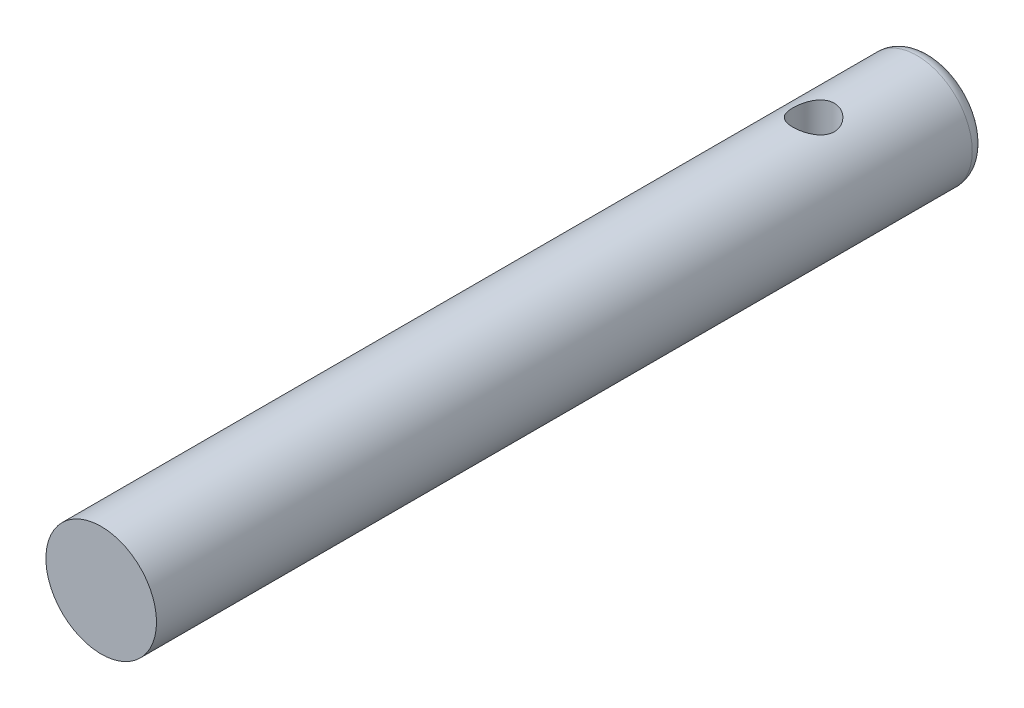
from build123d import *

# Parameters (mm, degrees)
SKETCH1_R               = 4
BOSS_EXTRUDE1_DEPTH     = 60
FILLET1_R               = 1
CUT_EXTRUDE1_DEPTH      = 10
CUT_EXTRUDE1_DEPTH_BACK = 10
SKETCH2_R               = 1.5


with BuildPart() as part:
    # Sketch1 → Boss-Extrude1 (new body)
    with BuildSketch(Plane.XY):
        Circle(SKETCH1_R)
    extrude(amount=BOSS_EXTRUDE1_DEPTH)

    # Fillet1
    fillet1_edges = [part.edges().sort_by_distance(p)[0] for p in [
        (-4, 0, 0),
    ]]
    fillet(fillet1_edges, radius=FILLET1_R)

    # Sketch2 → Cut-Extrude1 (cut, two sides: drawn at the far end of the back side and taken through both)
    with BuildSketch(Plane(origin=(0, 0, 0), x_dir=(1, 0, 0), z_dir=(0, 1, 0)).offset(-CUT_EXTRUDE1_DEPTH_BACK)):
        with Locations(Location((0, -8.48, 0), (0, 0, 90))):
            Circle(SKETCH2_R)
    extrude(amount=CUT_EXTRUDE1_DEPTH + CUT_EXTRUDE1_DEPTH_BACK, mode=Mode.SUBTRACT)


solid = part.part
